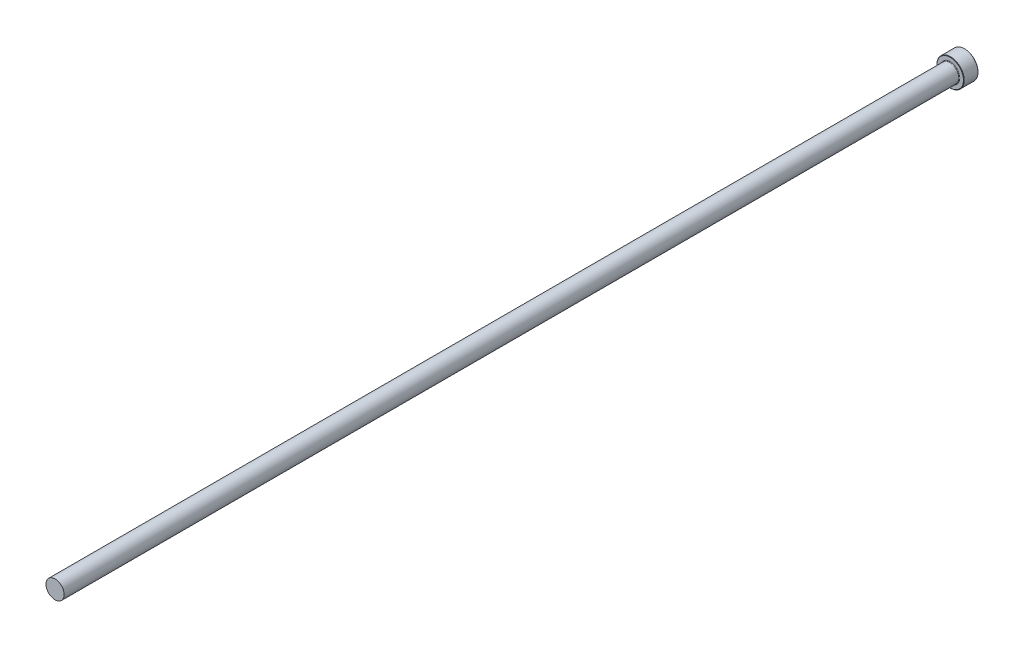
from build123d import *

# Parameters (mm, degrees)
CHAMFER1_SIZE = 0.2


with BuildPart() as part:
    # Sketch1 → Revolve1 (revolve)
    with BuildSketch(Plane(origin=(0, 0, 0), x_dir=(0, 0, -1), z_dir=(1, 0, 0)), mode=Mode.PRIVATE) as revolve1_sk:
        with BuildLine():
            Line((0, 0), (0, 7.5))
            Line((0, 7.5), (-8, 7.5))
            Line((-8, 7.5), (-8, 5.3))
            ThreePointArc((-8, 5.3), (-8.087867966, 5.087867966), (-8.3, 5))
            Line((-8.3, 5), (-500, 5))
            Line((-500, 5), (-500, 0))
            Line((-500, 0), (0, 0))
        make_face()
    revolve(revolve1_sk.sketch.rotate(Axis((0, 0, 109.05062828), (0, 0, -1)), 90), axis=Axis((0, 0, 109.05062828), (0, 0, -1)))

    # Chamfer1
    chamfer1_edges = [part.edges().sort_by_distance(p)[0] for p in [
        (-7.5, 0, 0),
        (-7.5, 0, 8),
    ]]
    chamfer(chamfer1_edges, length=CHAMFER1_SIZE)


solid = part.part
